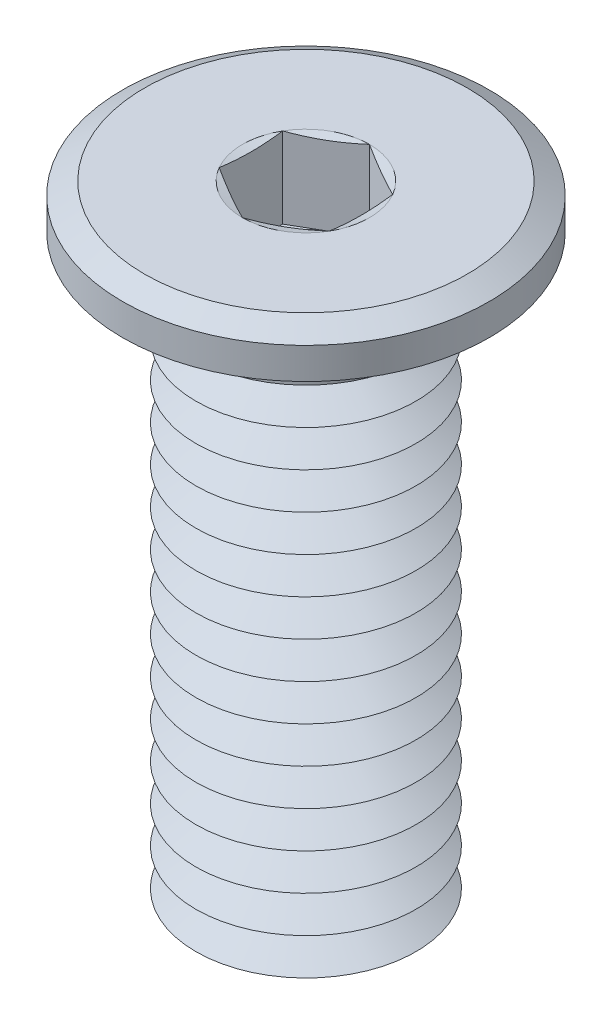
ISO-10303-21;
HEADER;
FILE_DESCRIPTION(('STEP AP214'),'2;1');
FILE_NAME('part.step','',(''),(''),'','','');
FILE_SCHEMA(('AUTOMOTIVE_DESIGN { 1 0 10303 214 1 1 1 1 }'));
ENDSEC;
DATA;
#1=APPLICATION_CONTEXT('core data for automotive mechanical design processes');
#2=APPLICATION_PROTOCOL_DEFINITION('international standard','automotive_design',2000,#1);
#3=PRODUCT_CONTEXT('',#1,'mechanical');
#4=PRODUCT('Part','Part','',(#3));
#5=PRODUCT_RELATED_PRODUCT_CATEGORY('part','',(#4));
#6=PRODUCT_DEFINITION_FORMATION('','',#4);
#7=PRODUCT_DEFINITION_CONTEXT('part definition',#1,'design');
#8=PRODUCT_DEFINITION('design','',#6,#7);
#9=PRODUCT_DEFINITION_SHAPE('','',#8);
#10=(LENGTH_UNIT() NAMED_UNIT(*) SI_UNIT(.MILLI.,.METRE.));
#11=(NAMED_UNIT(*) PLANE_ANGLE_UNIT() SI_UNIT($,.RADIAN.));
#12=(NAMED_UNIT(*) SI_UNIT($,.STERADIAN.) SOLID_ANGLE_UNIT());
#13=UNCERTAINTY_MEASURE_WITH_UNIT(LENGTH_MEASURE(1.E-05),#10,'distance_accuracy_value','');
#14=(GEOMETRIC_REPRESENTATION_CONTEXT(3) GLOBAL_UNCERTAINTY_ASSIGNED_CONTEXT((#13)) GLOBAL_UNIT_ASSIGNED_CONTEXT((#10,
#11,#12)) REPRESENTATION_CONTEXT('',''));
#15=CARTESIAN_POINT('',(0.,0.,0.));
#16=DIRECTION('',(0.,0.,1.));
#17=DIRECTION('',(1.,0.,0.));
#18=AXIS2_PLACEMENT_3D('',#15,#16,#17);
#19=CARTESIAN_POINT('',(0.,-15.7,0.));
#20=DIRECTION('',(0.,-1.,0.));
#21=DIRECTION('',(0.,0.,-1.));
#22=AXIS2_PLACEMENT_3D('',#19,#20,#21);
#23=CONICAL_SURFACE('',#22,3.,1.0471975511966);
#24=CARTESIAN_POINT('',(0.,-15.2,0.));
#25=DIRECTION('',(0.,1.,0.));
#26=DIRECTION('',(0.,0.,1.));
#27=AXIS2_PLACEMENT_3D('',#24,#25,#26);
#28=CIRCLE('',#27,2.13397459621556);
#29=CARTESIAN_POINT('',(0.,-15.2,2.13397459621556));
#30=VERTEX_POINT('',#29);
#31=EDGE_CURVE('E474',#30,#30,#28,.T.);
#32=ORIENTED_EDGE('',*,*,#31,.F.);
#33=EDGE_LOOP('',(#32));
#34=FACE_BOUND('',#33,.T.);
#35=CARTESIAN_POINT('',(0.,-15.7,0.));
#36=DIRECTION('',(0.,1.,0.));
#37=DIRECTION('',(0.,0.,1.));
#38=AXIS2_PLACEMENT_3D('',#35,#36,#37);
#39=CIRCLE('',#38,3.);
#40=CARTESIAN_POINT('',(0.,-15.7,3.));
#41=VERTEX_POINT('',#40);
#42=EDGE_CURVE('E478',#41,#41,#39,.T.);
#43=ORIENTED_EDGE('',*,*,#42,.T.);
#44=EDGE_LOOP('',(#43));
#45=FACE_BOUND('',#44,.T.);
#46=ADVANCED_FACE('F39',(#34,#45),#23,.T.);
#47=CARTESIAN_POINT('',(0.,-15.2,0.));
#48=DIRECTION('',(0.,1.,0.));
#49=DIRECTION('',(0.,0.,1.));
#50=AXIS2_PLACEMENT_3D('',#47,#48,#49);
#51=CONICAL_SURFACE('',#50,2.13397459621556,1.0471975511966);
#52=CARTESIAN_POINT('',(0.,-14.7,0.));
#53=DIRECTION('',(0.,1.,0.));
#54=DIRECTION('',(0.,0.,1.));
#55=AXIS2_PLACEMENT_3D('',#52,#53,#54);
#56=CIRCLE('',#55,3.);
#57=CARTESIAN_POINT('',(0.,-14.7,3.));
#58=VERTEX_POINT('',#57);
#59=EDGE_CURVE('E471',#58,#58,#56,.T.);
#60=ORIENTED_EDGE('',*,*,#59,.F.);
#61=EDGE_LOOP('',(#60));
#62=FACE_BOUND('',#61,.T.);
#63=ORIENTED_EDGE('',*,*,#31,.T.);
#64=EDGE_LOOP('',(#63));
#65=FACE_BOUND('',#64,.T.);
#66=ADVANCED_FACE('F233',(#62,#65),#51,.T.);
#67=CARTESIAN_POINT('',(0.,-17.2,0.));
#68=DIRECTION('',(0.,-1.,0.));
#69=DIRECTION('',(0.,0.,-1.));
#70=AXIS2_PLACEMENT_3D('',#67,#68,#69);
#71=PLANE('',#70);
#72=CARTESIAN_POINT('',(0.,-17.2,0.));
#73=DIRECTION('',(0.,1.,0.));
#74=DIRECTION('',(0.,0.,1.));
#75=AXIS2_PLACEMENT_3D('',#72,#73,#74);
#76=CIRCLE('',#75,2.13397459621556);
#77=CARTESIAN_POINT('',(0.,-17.2,2.13397459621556));
#78=VERTEX_POINT('',#77);
#79=EDGE_CURVE('E299',#78,#78,#76,.T.);
#80=ORIENTED_EDGE('',*,*,#79,.F.);
#81=EDGE_LOOP('',(#80));
#82=FACE_BOUND('',#81,.T.);
#83=ADVANCED_FACE('F239',(#82),#71,.T.);
#84=CARTESIAN_POINT('',(0.,-17.2,0.));
#85=DIRECTION('',(0.,1.,0.));
#86=DIRECTION('',(0.,0.,1.));
#87=AXIS2_PLACEMENT_3D('',#84,#85,#86);
#88=CONICAL_SURFACE('',#87,2.13397459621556,1.0471975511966);
#89=CARTESIAN_POINT('',(0.,-16.7,0.));
#90=DIRECTION('',(0.,1.,0.));
#91=DIRECTION('',(0.,0.,1.));
#92=AXIS2_PLACEMENT_3D('',#89,#90,#91);
#93=CIRCLE('',#92,3.);
#94=CARTESIAN_POINT('',(0.,-16.7,3.));
#95=VERTEX_POINT('',#94);
#96=EDGE_CURVE('E486',#95,#95,#93,.T.);
#97=ORIENTED_EDGE('',*,*,#96,.F.);
#98=EDGE_LOOP('',(#97));
#99=FACE_BOUND('',#98,.T.);
#100=ORIENTED_EDGE('',*,*,#79,.T.);
#101=EDGE_LOOP('',(#100));
#102=FACE_BOUND('',#101,.T.);
#103=ADVANCED_FACE('F254',(#99,#102),#88,.T.);
#104=CARTESIAN_POINT('',(0.,-16.7,0.));
#105=DIRECTION('',(0.,-1.,0.));
#106=DIRECTION('',(0.,0.,-1.));
#107=AXIS2_PLACEMENT_3D('',#104,#105,#106);
#108=CONICAL_SURFACE('',#107,3.,1.0471975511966);
#109=CARTESIAN_POINT('',(0.,-16.2,0.));
#110=DIRECTION('',(0.,1.,0.));
#111=DIRECTION('',(0.,0.,1.));
#112=AXIS2_PLACEMENT_3D('',#109,#110,#111);
#113=CIRCLE('',#112,2.13397459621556);
#114=CARTESIAN_POINT('',(0.,-16.2,2.13397459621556));
#115=VERTEX_POINT('',#114);
#116=EDGE_CURVE('E482',#115,#115,#113,.T.);
#117=ORIENTED_EDGE('',*,*,#116,.F.);
#118=EDGE_LOOP('',(#117));
#119=FACE_BOUND('',#118,.T.);
#120=ORIENTED_EDGE('',*,*,#96,.T.);
#121=EDGE_LOOP('',(#120));
#122=FACE_BOUND('',#121,.T.);
#123=ADVANCED_FACE('F250',(#119,#122),#108,.T.);
#124=CARTESIAN_POINT('',(0.,-16.2,0.));
#125=DIRECTION('',(0.,1.,0.));
#126=DIRECTION('',(0.,0.,1.));
#127=AXIS2_PLACEMENT_3D('',#124,#125,#126);
#128=CONICAL_SURFACE('',#127,2.13397459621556,1.0471975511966);
#129=ORIENTED_EDGE('',*,*,#42,.F.);
#130=EDGE_LOOP('',(#129));
#131=FACE_BOUND('',#130,.T.);
#132=ORIENTED_EDGE('',*,*,#116,.T.);
#133=EDGE_LOOP('',(#132));
#134=FACE_BOUND('',#133,.T.);
#135=ADVANCED_FACE('F246',(#131,#134),#128,.T.);
#136=CARTESIAN_POINT('',(0.,-14.7,0.));
#137=DIRECTION('',(0.,-1.,0.));
#138=DIRECTION('',(0.,0.,-1.));
#139=AXIS2_PLACEMENT_3D('',#136,#137,#138);
#140=CONICAL_SURFACE('',#139,3.,1.0471975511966);
#141=CARTESIAN_POINT('',(0.,-14.2,0.));
#142=DIRECTION('',(0.,1.,0.));
#143=DIRECTION('',(0.,0.,1.));
#144=AXIS2_PLACEMENT_3D('',#141,#142,#143);
#145=CIRCLE('',#144,2.13397459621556);
#146=CARTESIAN_POINT('',(0.,-14.2,2.13397459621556));
#147=VERTEX_POINT('',#146);
#148=EDGE_CURVE('E467',#147,#147,#145,.T.);
#149=ORIENTED_EDGE('',*,*,#148,.F.);
#150=EDGE_LOOP('',(#149));
#151=FACE_BOUND('',#150,.T.);
#152=ORIENTED_EDGE('',*,*,#59,.T.);
#153=EDGE_LOOP('',(#152));
#154=FACE_BOUND('',#153,.T.);
#155=ADVANCED_FACE('F249',(#151,#154),#140,.T.);
#156=CARTESIAN_POINT('',(0.,-14.2,0.));
#157=DIRECTION('',(0.,1.,0.));
#158=DIRECTION('',(0.,0.,1.));
#159=AXIS2_PLACEMENT_3D('',#156,#157,#158);
#160=CONICAL_SURFACE('',#159,2.13397459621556,1.0471975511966);
#161=CARTESIAN_POINT('',(0.,-13.7,0.));
#162=DIRECTION('',(0.,1.,0.));
#163=DIRECTION('',(0.,0.,1.));
#164=AXIS2_PLACEMENT_3D('',#161,#162,#163);
#165=CIRCLE('',#164,3.);
#166=CARTESIAN_POINT('',(0.,-13.7,3.));
#167=VERTEX_POINT('',#166);
#168=EDGE_CURVE('E463',#167,#167,#165,.T.);
#169=ORIENTED_EDGE('',*,*,#168,.F.);
#170=EDGE_LOOP('',(#169));
#171=FACE_BOUND('',#170,.T.);
#172=ORIENTED_EDGE('',*,*,#148,.T.);
#173=EDGE_LOOP('',(#172));
#174=FACE_BOUND('',#173,.T.);
#175=ADVANCED_FACE('F633',(#171,#174),#160,.T.);
#176=CARTESIAN_POINT('',(0.,-13.7,0.));
#177=DIRECTION('',(0.,-1.,0.));
#178=DIRECTION('',(0.,0.,-1.));
#179=AXIS2_PLACEMENT_3D('',#176,#177,#178);
#180=CONICAL_SURFACE('',#179,3.,1.0471975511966);
#181=CARTESIAN_POINT('',(0.,-13.2,0.));
#182=DIRECTION('',(0.,1.,0.));
#183=DIRECTION('',(0.,0.,1.));
#184=AXIS2_PLACEMENT_3D('',#181,#182,#183);
#185=CIRCLE('',#184,2.13397459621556);
#186=CARTESIAN_POINT('',(0.,-13.2,2.13397459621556));
#187=VERTEX_POINT('',#186);
#188=EDGE_CURVE('E460',#187,#187,#185,.T.);
#189=ORIENTED_EDGE('',*,*,#188,.F.);
#190=EDGE_LOOP('',(#189));
#191=FACE_BOUND('',#190,.T.);
#192=ORIENTED_EDGE('',*,*,#168,.T.);
#193=EDGE_LOOP('',(#192));
#194=FACE_BOUND('',#193,.T.);
#195=ADVANCED_FACE('F629',(#191,#194),#180,.T.);
#196=CARTESIAN_POINT('',(0.,-13.2,0.));
#197=DIRECTION('',(0.,1.,0.));
#198=DIRECTION('',(0.,0.,1.));
#199=AXIS2_PLACEMENT_3D('',#196,#197,#198);
#200=CONICAL_SURFACE('',#199,2.13397459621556,1.0471975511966);
#201=CARTESIAN_POINT('',(0.,-12.7,0.));
#202=DIRECTION('',(0.,1.,0.));
#203=DIRECTION('',(0.,0.,1.));
#204=AXIS2_PLACEMENT_3D('',#201,#202,#203);
#205=CIRCLE('',#204,3.);
#206=CARTESIAN_POINT('',(0.,-12.7,3.));
#207=VERTEX_POINT('',#206);
#208=EDGE_CURVE('E456',#207,#207,#205,.T.);
#209=ORIENTED_EDGE('',*,*,#208,.F.);
#210=EDGE_LOOP('',(#209));
#211=FACE_BOUND('',#210,.T.);
#212=ORIENTED_EDGE('',*,*,#188,.T.);
#213=EDGE_LOOP('',(#212));
#214=FACE_BOUND('',#213,.T.);
#215=ADVANCED_FACE('F625',(#211,#214),#200,.T.);
#216=CARTESIAN_POINT('',(0.,-12.7,0.));
#217=DIRECTION('',(0.,-1.,0.));
#218=DIRECTION('',(0.,0.,-1.));
#219=AXIS2_PLACEMENT_3D('',#216,#217,#218);
#220=CONICAL_SURFACE('',#219,3.,1.0471975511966);
#221=CARTESIAN_POINT('',(0.,-12.2,0.));
#222=DIRECTION('',(0.,1.,0.));
#223=DIRECTION('',(0.,0.,1.));
#224=AXIS2_PLACEMENT_3D('',#221,#222,#223);
#225=CIRCLE('',#224,2.13397459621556);
#226=CARTESIAN_POINT('',(0.,-12.2,2.13397459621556));
#227=VERTEX_POINT('',#226);
#228=EDGE_CURVE('E452',#227,#227,#225,.T.);
#229=ORIENTED_EDGE('',*,*,#228,.F.);
#230=EDGE_LOOP('',(#229));
#231=FACE_BOUND('',#230,.T.);
#232=ORIENTED_EDGE('',*,*,#208,.T.);
#233=EDGE_LOOP('',(#232));
#234=FACE_BOUND('',#233,.T.);
#235=ADVANCED_FACE('F621',(#231,#234),#220,.T.);
#236=CARTESIAN_POINT('',(0.,-12.2,0.));
#237=DIRECTION('',(0.,1.,0.));
#238=DIRECTION('',(0.,0.,1.));
#239=AXIS2_PLACEMENT_3D('',#236,#237,#238);
#240=CONICAL_SURFACE('',#239,2.13397459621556,1.0471975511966);
#241=CARTESIAN_POINT('',(0.,-11.7,0.));
#242=DIRECTION('',(0.,1.,0.));
#243=DIRECTION('',(0.,0.,1.));
#244=AXIS2_PLACEMENT_3D('',#241,#242,#243);
#245=CIRCLE('',#244,3.);
#246=CARTESIAN_POINT('',(0.,-11.7,3.));
#247=VERTEX_POINT('',#246);
#248=EDGE_CURVE('E448',#247,#247,#245,.T.);
#249=ORIENTED_EDGE('',*,*,#248,.F.);
#250=EDGE_LOOP('',(#249));
#251=FACE_BOUND('',#250,.T.);
#252=ORIENTED_EDGE('',*,*,#228,.T.);
#253=EDGE_LOOP('',(#252));
#254=FACE_BOUND('',#253,.T.);
#255=ADVANCED_FACE('F617',(#251,#254),#240,.T.);
#256=CARTESIAN_POINT('',(0.,-11.7,0.));
#257=DIRECTION('',(0.,-1.,0.));
#258=DIRECTION('',(0.,0.,-1.));
#259=AXIS2_PLACEMENT_3D('',#256,#257,#258);
#260=CONICAL_SURFACE('',#259,3.,1.0471975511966);
#261=CARTESIAN_POINT('',(0.,-11.2,0.));
#262=DIRECTION('',(0.,1.,0.));
#263=DIRECTION('',(0.,0.,1.));
#264=AXIS2_PLACEMENT_3D('',#261,#262,#263);
#265=CIRCLE('',#264,2.13397459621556);
#266=CARTESIAN_POINT('',(0.,-11.2,2.13397459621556));
#267=VERTEX_POINT('',#266);
#268=EDGE_CURVE('E445',#267,#267,#265,.T.);
#269=ORIENTED_EDGE('',*,*,#268,.F.);
#270=EDGE_LOOP('',(#269));
#271=FACE_BOUND('',#270,.T.);
#272=ORIENTED_EDGE('',*,*,#248,.T.);
#273=EDGE_LOOP('',(#272));
#274=FACE_BOUND('',#273,.T.);
#275=ADVANCED_FACE('F613',(#271,#274),#260,.T.);
#276=CARTESIAN_POINT('',(0.,-11.2,0.));
#277=DIRECTION('',(0.,1.,0.));
#278=DIRECTION('',(0.,0.,1.));
#279=AXIS2_PLACEMENT_3D('',#276,#277,#278);
#280=CONICAL_SURFACE('',#279,2.13397459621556,1.0471975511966);
#281=CARTESIAN_POINT('',(0.,-10.7,0.));
#282=DIRECTION('',(0.,1.,0.));
#283=DIRECTION('',(0.,0.,1.));
#284=AXIS2_PLACEMENT_3D('',#281,#282,#283);
#285=CIRCLE('',#284,3.);
#286=CARTESIAN_POINT('',(0.,-10.7,3.));
#287=VERTEX_POINT('',#286);
#288=EDGE_CURVE('E442',#287,#287,#285,.T.);
#289=ORIENTED_EDGE('',*,*,#288,.F.);
#290=EDGE_LOOP('',(#289));
#291=FACE_BOUND('',#290,.T.);
#292=ORIENTED_EDGE('',*,*,#268,.T.);
#293=EDGE_LOOP('',(#292));
#294=FACE_BOUND('',#293,.T.);
#295=ADVANCED_FACE('F609',(#291,#294),#280,.T.);
#296=CARTESIAN_POINT('',(0.,-10.7,0.));
#297=DIRECTION('',(0.,-1.,0.));
#298=DIRECTION('',(0.,0.,-1.));
#299=AXIS2_PLACEMENT_3D('',#296,#297,#298);
#300=CONICAL_SURFACE('',#299,3.,1.0471975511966);
#301=CARTESIAN_POINT('',(0.,-10.2,0.));
#302=DIRECTION('',(0.,1.,0.));
#303=DIRECTION('',(0.,0.,1.));
#304=AXIS2_PLACEMENT_3D('',#301,#302,#303);
#305=CIRCLE('',#304,2.13397459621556);
#306=CARTESIAN_POINT('',(0.,-10.2,2.13397459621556));
#307=VERTEX_POINT('',#306);
#308=EDGE_CURVE('E438',#307,#307,#305,.T.);
#309=ORIENTED_EDGE('',*,*,#308,.F.);
#310=EDGE_LOOP('',(#309));
#311=FACE_BOUND('',#310,.T.);
#312=ORIENTED_EDGE('',*,*,#288,.T.);
#313=EDGE_LOOP('',(#312));
#314=FACE_BOUND('',#313,.T.);
#315=ADVANCED_FACE('F605',(#311,#314),#300,.T.);
#316=CARTESIAN_POINT('',(0.,-10.2,0.));
#317=DIRECTION('',(0.,1.,0.));
#318=DIRECTION('',(0.,0.,1.));
#319=AXIS2_PLACEMENT_3D('',#316,#317,#318);
#320=CONICAL_SURFACE('',#319,2.13397459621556,1.0471975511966);
#321=CARTESIAN_POINT('',(0.,-9.7,0.));
#322=DIRECTION('',(0.,1.,0.));
#323=DIRECTION('',(0.,0.,1.));
#324=AXIS2_PLACEMENT_3D('',#321,#322,#323);
#325=CIRCLE('',#324,3.);
#326=CARTESIAN_POINT('',(0.,-9.7,3.));
#327=VERTEX_POINT('',#326);
#328=EDGE_CURVE('E434',#327,#327,#325,.T.);
#329=ORIENTED_EDGE('',*,*,#328,.F.);
#330=EDGE_LOOP('',(#329));
#331=FACE_BOUND('',#330,.T.);
#332=ORIENTED_EDGE('',*,*,#308,.T.);
#333=EDGE_LOOP('',(#332));
#334=FACE_BOUND('',#333,.T.);
#335=ADVANCED_FACE('F601',(#331,#334),#320,.T.);
#336=CARTESIAN_POINT('',(0.,-9.7,0.));
#337=DIRECTION('',(0.,-1.,0.));
#338=DIRECTION('',(0.,0.,-1.));
#339=AXIS2_PLACEMENT_3D('',#336,#337,#338);
#340=CONICAL_SURFACE('',#339,3.,1.0471975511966);
#341=CARTESIAN_POINT('',(0.,-9.2,0.));
#342=DIRECTION('',(0.,1.,0.));
#343=DIRECTION('',(0.,0.,1.));
#344=AXIS2_PLACEMENT_3D('',#341,#342,#343);
#345=CIRCLE('',#344,2.13397459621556);
#346=CARTESIAN_POINT('',(0.,-9.2,2.13397459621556));
#347=VERTEX_POINT('',#346);
#348=EDGE_CURVE('E430',#347,#347,#345,.T.);
#349=ORIENTED_EDGE('',*,*,#348,.F.);
#350=EDGE_LOOP('',(#349));
#351=FACE_BOUND('',#350,.T.);
#352=ORIENTED_EDGE('',*,*,#328,.T.);
#353=EDGE_LOOP('',(#352));
#354=FACE_BOUND('',#353,.T.);
#355=ADVANCED_FACE('F597',(#351,#354),#340,.T.);
#356=CARTESIAN_POINT('',(0.,-9.2,0.));
#357=DIRECTION('',(0.,1.,0.));
#358=DIRECTION('',(0.,0.,1.));
#359=AXIS2_PLACEMENT_3D('',#356,#357,#358);
#360=CONICAL_SURFACE('',#359,2.13397459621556,1.0471975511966);
#361=CARTESIAN_POINT('',(0.,-8.7,0.));
#362=DIRECTION('',(0.,1.,0.));
#363=DIRECTION('',(0.,0.,1.));
#364=AXIS2_PLACEMENT_3D('',#361,#362,#363);
#365=CIRCLE('',#364,3.);
#366=CARTESIAN_POINT('',(0.,-8.7,3.));
#367=VERTEX_POINT('',#366);
#368=EDGE_CURVE('E426',#367,#367,#365,.T.);
#369=ORIENTED_EDGE('',*,*,#368,.F.);
#370=EDGE_LOOP('',(#369));
#371=FACE_BOUND('',#370,.T.);
#372=ORIENTED_EDGE('',*,*,#348,.T.);
#373=EDGE_LOOP('',(#372));
#374=FACE_BOUND('',#373,.T.);
#375=ADVANCED_FACE('F593',(#371,#374),#360,.T.);
#376=CARTESIAN_POINT('',(0.,-8.7,0.));
#377=DIRECTION('',(0.,-1.,0.));
#378=DIRECTION('',(0.,0.,-1.));
#379=AXIS2_PLACEMENT_3D('',#376,#377,#378);
#380=CONICAL_SURFACE('',#379,3.,1.0471975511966);
#381=CARTESIAN_POINT('',(0.,-8.2,0.));
#382=DIRECTION('',(0.,1.,0.));
#383=DIRECTION('',(0.,0.,1.));
#384=AXIS2_PLACEMENT_3D('',#381,#382,#383);
#385=CIRCLE('',#384,2.13397459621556);
#386=CARTESIAN_POINT('',(0.,-8.2,2.13397459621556));
#387=VERTEX_POINT('',#386);
#388=EDGE_CURVE('E422',#387,#387,#385,.T.);
#389=ORIENTED_EDGE('',*,*,#388,.F.);
#390=EDGE_LOOP('',(#389));
#391=FACE_BOUND('',#390,.T.);
#392=ORIENTED_EDGE('',*,*,#368,.T.);
#393=EDGE_LOOP('',(#392));
#394=FACE_BOUND('',#393,.T.);
#395=ADVANCED_FACE('F589',(#391,#394),#380,.T.);
#396=CARTESIAN_POINT('',(0.,-8.2,0.));
#397=DIRECTION('',(0.,1.,0.));
#398=DIRECTION('',(0.,0.,1.));
#399=AXIS2_PLACEMENT_3D('',#396,#397,#398);
#400=CONICAL_SURFACE('',#399,2.13397459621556,1.0471975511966);
#401=CARTESIAN_POINT('',(0.,-7.7,0.));
#402=DIRECTION('',(0.,1.,0.));
#403=DIRECTION('',(0.,0.,1.));
#404=AXIS2_PLACEMENT_3D('',#401,#402,#403);
#405=CIRCLE('',#404,3.);
#406=CARTESIAN_POINT('',(0.,-7.7,3.));
#407=VERTEX_POINT('',#406);
#408=EDGE_CURVE('E418',#407,#407,#405,.T.);
#409=ORIENTED_EDGE('',*,*,#408,.F.);
#410=EDGE_LOOP('',(#409));
#411=FACE_BOUND('',#410,.T.);
#412=ORIENTED_EDGE('',*,*,#388,.T.);
#413=EDGE_LOOP('',(#412));
#414=FACE_BOUND('',#413,.T.);
#415=ADVANCED_FACE('F585',(#411,#414),#400,.T.);
#416=CARTESIAN_POINT('',(0.,-7.7,0.));
#417=DIRECTION('',(0.,-1.,0.));
#418=DIRECTION('',(0.,0.,-1.));
#419=AXIS2_PLACEMENT_3D('',#416,#417,#418);
#420=CONICAL_SURFACE('',#419,3.,1.0471975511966);
#421=CARTESIAN_POINT('',(0.,-7.2,0.));
#422=DIRECTION('',(0.,1.,0.));
#423=DIRECTION('',(0.,0.,1.));
#424=AXIS2_PLACEMENT_3D('',#421,#422,#423);
#425=CIRCLE('',#424,2.13397459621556);
#426=CARTESIAN_POINT('',(0.,-7.2,2.13397459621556));
#427=VERTEX_POINT('',#426);
#428=EDGE_CURVE('E414',#427,#427,#425,.T.);
#429=ORIENTED_EDGE('',*,*,#428,.F.);
#430=EDGE_LOOP('',(#429));
#431=FACE_BOUND('',#430,.T.);
#432=ORIENTED_EDGE('',*,*,#408,.T.);
#433=EDGE_LOOP('',(#432));
#434=FACE_BOUND('',#433,.T.);
#435=ADVANCED_FACE('F581',(#431,#434),#420,.T.);
#436=CARTESIAN_POINT('',(0.,-7.2,0.));
#437=DIRECTION('',(0.,1.,0.));
#438=DIRECTION('',(0.,0.,1.));
#439=AXIS2_PLACEMENT_3D('',#436,#437,#438);
#440=CONICAL_SURFACE('',#439,2.13397459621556,1.0471975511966);
#441=CARTESIAN_POINT('',(0.,-6.7,0.));
#442=DIRECTION('',(0.,1.,0.));
#443=DIRECTION('',(0.,0.,1.));
#444=AXIS2_PLACEMENT_3D('',#441,#442,#443);
#445=CIRCLE('',#444,3.);
#446=CARTESIAN_POINT('',(0.,-6.7,3.));
#447=VERTEX_POINT('',#446);
#448=EDGE_CURVE('E410',#447,#447,#445,.T.);
#449=ORIENTED_EDGE('',*,*,#448,.F.);
#450=EDGE_LOOP('',(#449));
#451=FACE_BOUND('',#450,.T.);
#452=ORIENTED_EDGE('',*,*,#428,.T.);
#453=EDGE_LOOP('',(#452));
#454=FACE_BOUND('',#453,.T.);
#455=ADVANCED_FACE('F577',(#451,#454),#440,.T.);
#456=CARTESIAN_POINT('',(0.,-6.7,0.));
#457=DIRECTION('',(0.,-1.,0.));
#458=DIRECTION('',(0.,0.,-1.));
#459=AXIS2_PLACEMENT_3D('',#456,#457,#458);
#460=CONICAL_SURFACE('',#459,3.,1.0471975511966);
#461=CARTESIAN_POINT('',(0.,-6.2,0.));
#462=DIRECTION('',(0.,1.,0.));
#463=DIRECTION('',(0.,0.,1.));
#464=AXIS2_PLACEMENT_3D('',#461,#462,#463);
#465=CIRCLE('',#464,2.13397459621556);
#466=CARTESIAN_POINT('',(0.,-6.2,2.13397459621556));
#467=VERTEX_POINT('',#466);
#468=EDGE_CURVE('E406',#467,#467,#465,.T.);
#469=ORIENTED_EDGE('',*,*,#468,.F.);
#470=EDGE_LOOP('',(#469));
#471=FACE_BOUND('',#470,.T.);
#472=ORIENTED_EDGE('',*,*,#448,.T.);
#473=EDGE_LOOP('',(#472));
#474=FACE_BOUND('',#473,.T.);
#475=ADVANCED_FACE('F573',(#471,#474),#460,.T.);
#476=CARTESIAN_POINT('',(0.,-6.2,0.));
#477=DIRECTION('',(0.,1.,0.));
#478=DIRECTION('',(0.,0.,1.));
#479=AXIS2_PLACEMENT_3D('',#476,#477,#478);
#480=CONICAL_SURFACE('',#479,2.13397459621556,1.0471975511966);
#481=CARTESIAN_POINT('',(0.,-5.7,0.));
#482=DIRECTION('',(0.,1.,0.));
#483=DIRECTION('',(0.,0.,1.));
#484=AXIS2_PLACEMENT_3D('',#481,#482,#483);
#485=CIRCLE('',#484,3.);
#486=CARTESIAN_POINT('',(0.,-5.7,3.));
#487=VERTEX_POINT('',#486);
#488=EDGE_CURVE('E402',#487,#487,#485,.T.);
#489=ORIENTED_EDGE('',*,*,#488,.F.);
#490=EDGE_LOOP('',(#489));
#491=FACE_BOUND('',#490,.T.);
#492=ORIENTED_EDGE('',*,*,#468,.T.);
#493=EDGE_LOOP('',(#492));
#494=FACE_BOUND('',#493,.T.);
#495=ADVANCED_FACE('F569',(#491,#494),#480,.T.);
#496=CARTESIAN_POINT('',(0.,-5.7,0.));
#497=DIRECTION('',(0.,-1.,0.));
#498=DIRECTION('',(0.,0.,-1.));
#499=AXIS2_PLACEMENT_3D('',#496,#497,#498);
#500=CONICAL_SURFACE('',#499,3.,1.0471975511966);
#501=CARTESIAN_POINT('',(0.,-5.2,0.));
#502=DIRECTION('',(0.,1.,0.));
#503=DIRECTION('',(0.,0.,1.));
#504=AXIS2_PLACEMENT_3D('',#501,#502,#503);
#505=CIRCLE('',#504,2.13397459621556);
#506=CARTESIAN_POINT('',(0.,-5.2,2.13397459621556));
#507=VERTEX_POINT('',#506);
#508=EDGE_CURVE('E398',#507,#507,#505,.T.);
#509=ORIENTED_EDGE('',*,*,#508,.F.);
#510=EDGE_LOOP('',(#509));
#511=FACE_BOUND('',#510,.T.);
#512=ORIENTED_EDGE('',*,*,#488,.T.);
#513=EDGE_LOOP('',(#512));
#514=FACE_BOUND('',#513,.T.);
#515=ADVANCED_FACE('F565',(#511,#514),#500,.T.);
#516=CARTESIAN_POINT('',(0.,-5.2,0.));
#517=DIRECTION('',(0.,1.,0.));
#518=DIRECTION('',(0.,0.,1.));
#519=AXIS2_PLACEMENT_3D('',#516,#517,#518);
#520=CONICAL_SURFACE('',#519,2.13397459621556,1.0471975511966);
#521=CARTESIAN_POINT('',(0.,-4.7,0.));
#522=DIRECTION('',(0.,1.,0.));
#523=DIRECTION('',(0.,0.,1.));
#524=AXIS2_PLACEMENT_3D('',#521,#522,#523);
#525=CIRCLE('',#524,3.);
#526=CARTESIAN_POINT('',(0.,-4.7,3.));
#527=VERTEX_POINT('',#526);
#528=EDGE_CURVE('E394',#527,#527,#525,.T.);
#529=ORIENTED_EDGE('',*,*,#528,.F.);
#530=EDGE_LOOP('',(#529));
#531=FACE_BOUND('',#530,.T.);
#532=ORIENTED_EDGE('',*,*,#508,.T.);
#533=EDGE_LOOP('',(#532));
#534=FACE_BOUND('',#533,.T.);
#535=ADVANCED_FACE('F561',(#531,#534),#520,.T.);
#536=CARTESIAN_POINT('',(0.,-4.7,0.));
#537=DIRECTION('',(0.,-1.,0.));
#538=DIRECTION('',(0.,0.,-1.));
#539=AXIS2_PLACEMENT_3D('',#536,#537,#538);
#540=CONICAL_SURFACE('',#539,3.,1.0471975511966);
#541=CARTESIAN_POINT('',(0.,-4.2,0.));
#542=DIRECTION('',(0.,1.,0.));
#543=DIRECTION('',(0.,0.,1.));
#544=AXIS2_PLACEMENT_3D('',#541,#542,#543);
#545=CIRCLE('',#544,2.13397459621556);
#546=CARTESIAN_POINT('',(0.,-4.2,2.13397459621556));
#547=VERTEX_POINT('',#546);
#548=EDGE_CURVE('E390',#547,#547,#545,.T.);
#549=ORIENTED_EDGE('',*,*,#548,.F.);
#550=EDGE_LOOP('',(#549));
#551=FACE_BOUND('',#550,.T.);
#552=ORIENTED_EDGE('',*,*,#528,.T.);
#553=EDGE_LOOP('',(#552));
#554=FACE_BOUND('',#553,.T.);
#555=ADVANCED_FACE('F557',(#551,#554),#540,.T.);
#556=CARTESIAN_POINT('',(0.,-4.2,0.));
#557=DIRECTION('',(0.,1.,0.));
#558=DIRECTION('',(0.,0.,1.));
#559=AXIS2_PLACEMENT_3D('',#556,#557,#558);
#560=CONICAL_SURFACE('',#559,2.13397459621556,1.0471975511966);
#561=CARTESIAN_POINT('',(0.,-3.7,0.));
#562=DIRECTION('',(0.,1.,0.));
#563=DIRECTION('',(0.,0.,1.));
#564=AXIS2_PLACEMENT_3D('',#561,#562,#563);
#565=CIRCLE('',#564,3.);
#566=CARTESIAN_POINT('',(0.,-3.7,3.));
#567=VERTEX_POINT('',#566);
#568=EDGE_CURVE('E386',#567,#567,#565,.T.);
#569=ORIENTED_EDGE('',*,*,#568,.F.);
#570=EDGE_LOOP('',(#569));
#571=FACE_BOUND('',#570,.T.);
#572=ORIENTED_EDGE('',*,*,#548,.T.);
#573=EDGE_LOOP('',(#572));
#574=FACE_BOUND('',#573,.T.);
#575=ADVANCED_FACE('F553',(#571,#574),#560,.T.);
#576=CARTESIAN_POINT('',(0.,-3.7,0.));
#577=DIRECTION('',(0.,-1.,0.));
#578=DIRECTION('',(0.,0.,-1.));
#579=AXIS2_PLACEMENT_3D('',#576,#577,#578);
#580=CONICAL_SURFACE('',#579,3.,1.0471975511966);
#581=CARTESIAN_POINT('',(0.,-3.2,0.));
#582=DIRECTION('',(0.,1.,0.));
#583=DIRECTION('',(0.,0.,1.));
#584=AXIS2_PLACEMENT_3D('',#581,#582,#583);
#585=CIRCLE('',#584,2.13397459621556);
#586=CARTESIAN_POINT('',(0.,-3.2,2.13397459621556));
#587=VERTEX_POINT('',#586);
#588=EDGE_CURVE('E382',#587,#587,#585,.T.);
#589=ORIENTED_EDGE('',*,*,#588,.F.);
#590=EDGE_LOOP('',(#589));
#591=FACE_BOUND('',#590,.T.);
#592=ORIENTED_EDGE('',*,*,#568,.T.);
#593=EDGE_LOOP('',(#592));
#594=FACE_BOUND('',#593,.T.);
#595=ADVANCED_FACE('F549',(#591,#594),#580,.T.);
#596=CARTESIAN_POINT('',(0.,-3.2,0.));
#597=DIRECTION('',(0.,1.,0.));
#598=DIRECTION('',(0.,0.,1.));
#599=AXIS2_PLACEMENT_3D('',#596,#597,#598);
#600=CONICAL_SURFACE('',#599,2.13397459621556,1.0471975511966);
#601=CARTESIAN_POINT('',(0.,-2.7,0.));
#602=DIRECTION('',(0.,1.,0.));
#603=DIRECTION('',(0.,0.,1.));
#604=AXIS2_PLACEMENT_3D('',#601,#602,#603);
#605=CIRCLE('',#604,3.);
#606=CARTESIAN_POINT('',(0.,-2.7,3.));
#607=VERTEX_POINT('',#606);
#608=EDGE_CURVE('E366',#607,#607,#605,.T.);
#609=ORIENTED_EDGE('',*,*,#608,.F.);
#610=EDGE_LOOP('',(#609));
#611=FACE_BOUND('',#610,.T.);
#612=ORIENTED_EDGE('',*,*,#588,.T.);
#613=EDGE_LOOP('',(#612));
#614=FACE_BOUND('',#613,.T.);
#615=ADVANCED_FACE('F274',(#611,#614),#600,.T.);
#616=CARTESIAN_POINT('',(0.,0.,0.));
#617=DIRECTION('',(0.,1.,0.));
#618=DIRECTION('',(0.,0.,1.));
#619=AXIS2_PLACEMENT_3D('',#616,#617,#618);
#620=PLANE('',#619);
#621=CARTESIAN_POINT('',(0.,0.,0.));
#622=DIRECTION('',(0.,1.,0.));
#623=DIRECTION('',(0.,0.,1.));
#624=AXIS2_PLACEMENT_3D('',#621,#622,#623);
#625=CIRCLE('',#624,1.73205080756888);
#626=CARTESIAN_POINT('',(0.,0.,1.73205080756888));
#627=VERTEX_POINT('',#626);
#628=CARTESIAN_POINT('',(1.5,0.,0.86602540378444));
#629=VERTEX_POINT('',#628);
#630=EDGE_CURVE('E66',#627,#629,#625,.T.);
#631=ORIENTED_EDGE('',*,*,#630,.F.);
#632=CARTESIAN_POINT('',(-1.5,0.,0.866025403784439));
#633=VERTEX_POINT('',#632);
#634=EDGE_CURVE('E169',#633,#627,#625,.T.);
#635=ORIENTED_EDGE('',*,*,#634,.F.);
#636=CARTESIAN_POINT('',(-1.5,0.,-0.86602540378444));
#637=VERTEX_POINT('',#636);
#638=EDGE_CURVE('E164',#637,#633,#625,.T.);
#639=ORIENTED_EDGE('',*,*,#638,.F.);
#640=CARTESIAN_POINT('',(0.,0.,-1.73205080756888));
#641=VERTEX_POINT('',#640);
#642=EDGE_CURVE('E128',#641,#637,#625,.T.);
#643=ORIENTED_EDGE('',*,*,#642,.F.);
#644=CARTESIAN_POINT('',(1.5,0.,-0.866025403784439));
#645=VERTEX_POINT('',#644);
#646=EDGE_CURVE('E119',#645,#641,#625,.T.);
#647=ORIENTED_EDGE('',*,*,#646,.F.);
#648=EDGE_CURVE('E59',#629,#645,#625,.T.);
#649=ORIENTED_EDGE('',*,*,#648,.F.);
#650=EDGE_LOOP('',(#631,#635,#639,#643,#647,#649));
#651=FACE_BOUND('',#650,.T.);
#652=CARTESIAN_POINT('',(0.,0.,0.));
#653=DIRECTION('',(0.,1.,0.));
#654=DIRECTION('',(0.,0.,1.));
#655=AXIS2_PLACEMENT_3D('',#652,#653,#654);
#656=CIRCLE('',#655,4.4);
#657=CARTESIAN_POINT('',(0.,0.,4.4));
#658=VERTEX_POINT('',#657);
#659=EDGE_CURVE('E295',#658,#658,#656,.T.);
#660=ORIENTED_EDGE('',*,*,#659,.T.);
#661=EDGE_LOOP('',(#660));
#662=FACE_BOUND('',#661,.T.);
#663=ADVANCED_FACE('F160',(#651,#662),#620,.T.);
#664=CARTESIAN_POINT('',(0.,-1.2,0.));
#665=DIRECTION('',(0.,1.,0.));
#666=DIRECTION('',(0.,0.,1.));
#667=AXIS2_PLACEMENT_3D('',#664,#665,#666);
#668=CYLINDRICAL_SURFACE('',#667,5.);
#669=CARTESIAN_POINT('',(0.,-0.346410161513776,0.));
#670=DIRECTION('',(0.,1.,0.));
#671=DIRECTION('',(0.,0.,1.));
#672=AXIS2_PLACEMENT_3D('',#669,#670,#671);
#673=CIRCLE('',#672,5.);
#674=CARTESIAN_POINT('',(0.,-0.346410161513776,5.));
#675=VERTEX_POINT('',#674);
#676=EDGE_CURVE('E306',#675,#675,#673,.F.);
#677=ORIENTED_EDGE('',*,*,#676,.T.);
#678=EDGE_LOOP('',(#677));
#679=FACE_BOUND('',#678,.T.);
#680=CARTESIAN_POINT('',(0.,-1.2,0.));
#681=DIRECTION('',(0.,1.,0.));
#682=DIRECTION('',(0.,0.,1.));
#683=AXIS2_PLACEMENT_3D('',#680,#681,#682);
#684=CIRCLE('',#683,5.);
#685=CARTESIAN_POINT('',(0.,-1.2,5.));
#686=VERTEX_POINT('',#685);
#687=EDGE_CURVE('E291',#686,#686,#684,.T.);
#688=ORIENTED_EDGE('',*,*,#687,.T.);
#689=EDGE_LOOP('',(#688));
#690=FACE_BOUND('',#689,.T.);
#691=ADVANCED_FACE('F270',(#679,#690),#668,.T.);
#692=CARTESIAN_POINT('',(0.,-1.2,0.));
#693=DIRECTION('',(0.,1.,0.));
#694=DIRECTION('',(0.,0.,1.));
#695=AXIS2_PLACEMENT_3D('',#692,#693,#694);
#696=PLANE('',#695);
#697=CARTESIAN_POINT('',(0.,-1.2,0.));
#698=DIRECTION('',(0.,1.,0.));
#699=DIRECTION('',(0.,0.,1.));
#700=AXIS2_PLACEMENT_3D('',#697,#698,#699);
#701=CIRCLE('',#700,3.25);
#702=CARTESIAN_POINT('',(0.,-1.2,3.25));
#703=VERTEX_POINT('',#702);
#704=EDGE_CURVE('E286',#703,#703,#701,.T.);
#705=ORIENTED_EDGE('',*,*,#704,.T.);
#706=EDGE_LOOP('',(#705));
#707=FACE_BOUND('',#706,.T.);
#708=ORIENTED_EDGE('',*,*,#687,.F.);
#709=EDGE_LOOP('',(#708));
#710=FACE_BOUND('',#709,.T.);
#711=ADVANCED_FACE('F266',(#707,#710),#696,.F.);
#712=CARTESIAN_POINT('',(0.,-17.2,0.));
#713=DIRECTION('',(0.,1.,0.));
#714=DIRECTION('',(0.,0.,1.));
#715=AXIS2_PLACEMENT_3D('',#712,#713,#714);
#716=CYLINDRICAL_SURFACE('',#715,3.);
#717=CARTESIAN_POINT('',(0.,-1.45,0.));
#718=DIRECTION('',(0.,1.,0.));
#719=DIRECTION('',(0.,0.,1.));
#720=AXIS2_PLACEMENT_3D('',#717,#718,#719);
#721=CIRCLE('',#720,3.);
#722=CARTESIAN_POINT('',(0.,-1.45,3.));
#723=VERTEX_POINT('',#722);
#724=EDGE_CURVE('E289',#723,#723,#721,.F.);
#725=ORIENTED_EDGE('',*,*,#724,.T.);
#726=EDGE_LOOP('',(#725));
#727=FACE_BOUND('',#726,.T.);
#728=ORIENTED_EDGE('',*,*,#608,.T.);
#729=EDGE_LOOP('',(#728));
#730=FACE_BOUND('',#729,.T.);
#731=ADVANCED_FACE('F262',(#727,#730),#716,.T.);
#732=CARTESIAN_POINT('',(0.,-1.45,0.));
#733=DIRECTION('',(0.,1.,0.));
#734=DIRECTION('',(0.,0.,1.));
#735=AXIS2_PLACEMENT_3D('',#732,#733,#734);
#736=TOROIDAL_SURFACE('',#735,3.25,0.25);
#737=ORIENTED_EDGE('',*,*,#704,.F.);
#738=EDGE_LOOP('',(#737));
#739=FACE_BOUND('',#738,.T.);
#740=ORIENTED_EDGE('',*,*,#724,.F.);
#741=EDGE_LOOP('',(#740));
#742=FACE_BOUND('',#741,.T.);
#743=ADVANCED_FACE('F265',(#739,#742),#736,.F.);
#744=CARTESIAN_POINT('',(0.,0.,0.));
#745=DIRECTION('',(0.,-1.,0.));
#746=DIRECTION('',(0.,0.,-1.));
#747=AXIS2_PLACEMENT_3D('',#744,#745,#746);
#748=CONICAL_SURFACE('',#747,4.4,1.0471975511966);
#749=ORIENTED_EDGE('',*,*,#676,.F.);
#750=EDGE_LOOP('',(#749));
#751=FACE_BOUND('',#750,.T.);
#752=ORIENTED_EDGE('',*,*,#659,.F.);
#753=EDGE_LOOP('',(#752));
#754=FACE_BOUND('',#753,.T.);
#755=ADVANCED_FACE('F41',(#751,#754),#748,.T.);
#756=CARTESIAN_POINT('',(0.,0.,0.));
#757=DIRECTION('',(0.,1.,0.));
#758=DIRECTION('',(0.,0.,1.));
#759=AXIS2_PLACEMENT_3D('',#756,#757,#758);
#760=CONICAL_SURFACE('',#759,1.73205080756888,1.30899693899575);
#761=ORIENTED_EDGE('',*,*,#642,.T.);
#762=CARTESIAN_POINT('',(0.000200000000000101,3.09432014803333E-05,-1.73216627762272));
#763=CARTESIAN_POINT('',(-0.0621077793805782,-0.00961367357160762,-1.69619286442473));
#764=CARTESIAN_POINT('',(-0.124528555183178,-0.0183695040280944,-1.66015421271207));
#765=CARTESIAN_POINT('',(-0.249590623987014,-0.0337528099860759,-1.58794959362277));
#766=CARTESIAN_POINT('',(-0.312231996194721,-0.0403794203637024,-1.55178358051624));
#767=CARTESIAN_POINT('',(-0.437355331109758,-0.0511173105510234,-1.47954358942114));
#768=CARTESIAN_POINT('',(-0.499836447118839,-0.0552413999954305,-1.44347010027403));
#769=CARTESIAN_POINT('',(-0.624878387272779,-0.0607713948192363,-1.37127710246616));
#770=CARTESIAN_POINT('',(-0.68743919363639,-0.0621778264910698,-1.33515760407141));
#771=CARTESIAN_POINT('',(-0.81256080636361,-0.0621778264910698,-1.26291860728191));
#772=CARTESIAN_POINT('',(-0.875121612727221,-0.0607713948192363,-1.22679910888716));
#773=CARTESIAN_POINT('',(-1.00016355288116,-0.0552413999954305,-1.15460611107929));
#774=CARTESIAN_POINT('',(-1.06264466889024,-0.0511173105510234,-1.11853262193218));
#775=CARTESIAN_POINT('',(-1.18776800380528,-0.0403794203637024,-1.04629263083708));
#776=CARTESIAN_POINT('',(-1.25040937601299,-0.0337528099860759,-1.01012661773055));
#777=CARTESIAN_POINT('',(-1.37547144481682,-0.0183695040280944,-0.937921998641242));
#778=CARTESIAN_POINT('',(-1.43789222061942,-0.00961367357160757,-0.901883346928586));
#779=CARTESIAN_POINT('',(-1.5002,3.09432014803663E-05,-0.865909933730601));
#780=B_SPLINE_CURVE_WITH_KNOTS('',3,(#762,#763,#764,#765,#766,#767,#768,#769,#770,#771,#772,
#773,#774,#775,#776,#777,#778,#779),.UNSPECIFIED.,.F.,.F.,(4,2,2,2,2,2,2,2,4),(0.,
0.217782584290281,0.435653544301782,0.652399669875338,0.869103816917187,1.08580796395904,
1.30255408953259,1.52042504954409,1.73820763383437),.UNSPECIFIED.);
#781=EDGE_CURVE('E11',#641,#637,#780,.T.);
#782=ORIENTED_EDGE('',*,*,#781,.F.);
#783=EDGE_LOOP('',(#761,#782));
#784=FACE_BOUND('',#783,.T.);
#785=ADVANCED_FACE('F132',(#784),#760,.F.);
#786=ORIENTED_EDGE('',*,*,#638,.T.);
#787=CARTESIAN_POINT('',(-1.5,0.354011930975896,-2.65937634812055));
#788=CARTESIAN_POINT('',(-1.5,0.324139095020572,-2.53120070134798));
#789=CARTESIAN_POINT('',(-1.5,0.294685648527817,-2.40292071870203));
#790=CARTESIAN_POINT('',(-1.5,0.237197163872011,-2.14601955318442));
#791=CARTESIAN_POINT('',(-1.5,0.209162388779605,-2.01739831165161));
#792=CARTESIAN_POINT('',(-1.5,0.154839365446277,-1.7584759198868));
#793=CARTESIAN_POINT('',(-1.5,0.128570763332,-1.62817060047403));
#794=CARTESIAN_POINT('',(-1.5,0.079114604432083,-1.36695300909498));
#795=CARTESIAN_POINT('',(-1.5,0.0559273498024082,-1.23604067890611));
#796=CARTESIAN_POINT('',(-1.5,0.014778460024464,-0.977065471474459));
#797=CARTESIAN_POINT('',(-1.5,-0.00330931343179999,-0.849023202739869));
#798=CARTESIAN_POINT('',(-1.5,-0.0330965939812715,-0.592203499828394));
#799=CARTESIAN_POINT('',(-1.5,-0.044798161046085,-0.463426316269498));
#800=CARTESIAN_POINT('',(-1.5,-0.0597912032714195,-0.205943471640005));
#801=CARTESIAN_POINT('',(-1.5,-0.0631209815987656,-0.0772401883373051));
#802=CARTESIAN_POINT('',(-1.5,-0.0607624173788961,0.180089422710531));
#803=CARTESIAN_POINT('',(-1.5,-0.0550734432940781,0.30871574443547));
#804=CARTESIAN_POINT('',(-1.5,-0.0385156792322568,0.529862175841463));
#805=CARTESIAN_POINT('',(-1.5,-0.0295136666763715,0.622533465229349));
#806=CARTESIAN_POINT('',(-1.5,-0.00818858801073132,0.807485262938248));
#807=CARTESIAN_POINT('',(-1.5,0.00413439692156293,0.899765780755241));
#808=CARTESIAN_POINT('',(-1.5,0.0313970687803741,1.08424538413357));
#809=CARTESIAN_POINT('',(-1.5,0.0463453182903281,1.17644317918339));
#810=CARTESIAN_POINT('',(-1.5,0.0781915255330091,1.36050255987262));
#811=CARTESIAN_POINT('',(-1.5,0.0950895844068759,1.45236412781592));
#812=CARTESIAN_POINT('',(-1.5,0.130717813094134,1.6377417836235));
#813=CARTESIAN_POINT('',(-1.5,0.149479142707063,1.73125183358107));
#814=CARTESIAN_POINT('',(-1.5,0.188141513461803,1.91803588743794));
#815=CARTESIAN_POINT('',(-1.5,0.208042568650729,2.01130988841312));
#816=CARTESIAN_POINT('',(-1.5,0.248588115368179,2.19713640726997));
#817=CARTESIAN_POINT('',(-1.5,0.269227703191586,2.28969000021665));
#818=CARTESIAN_POINT('',(-1.5,0.311169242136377,2.47464021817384));
#819=CARTESIAN_POINT('',(-1.5,0.332471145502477,2.5670368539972));
#820=CARTESIAN_POINT('',(-1.5,0.354011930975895,2.65937634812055));
#821=B_SPLINE_CURVE_WITH_KNOTS('',3,(#787,#788,#789,#790,#791,#792,#793,#794,#795,#796,#797,
#798,#799,#800,#801,#802,#803,#804,#805,#806,#807,#808,#809,#810,#811,#812,#813,#814,#815,#816,
#817,#818,#819,#820),.UNSPECIFIED.,.F.,.F.,(4,2,2,2,2,2,2,2,2,2,2,2,2,2,2,2,4),(0.,
0.3948412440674,0.789755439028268,1.18851185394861,1.58730734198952,1.97513907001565,
2.36284562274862,2.74877505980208,3.13473152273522,3.41398847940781,3.69323861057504,
3.97341705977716,4.25361004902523,4.53972148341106,4.82583644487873,5.1103147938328,
5.39477267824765),.UNSPECIFIED.);
#822=EDGE_CURVE('E172',#637,#633,#821,.T.);
#823=ORIENTED_EDGE('',*,*,#822,.F.);
#824=EDGE_LOOP('',(#786,#823));
#825=FACE_BOUND('',#824,.T.);
#826=ADVANCED_FACE('F745',(#825),#760,.F.);
#827=ORIENTED_EDGE('',*,*,#634,.T.);
#828=CARTESIAN_POINT('',(-1.5002,3.09432014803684E-05,0.865909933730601));
#829=CARTESIAN_POINT('',(-1.43789222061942,-0.00961367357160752,0.901883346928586));
#830=CARTESIAN_POINT('',(-1.37547144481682,-0.0183695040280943,0.937921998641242));
#831=CARTESIAN_POINT('',(-1.25040937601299,-0.0337528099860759,1.01012661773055));
#832=CARTESIAN_POINT('',(-1.18776800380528,-0.0403794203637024,1.04629263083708));
#833=CARTESIAN_POINT('',(-1.06264466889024,-0.0511173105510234,1.11853262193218));
#834=CARTESIAN_POINT('',(-1.00016355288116,-0.0552413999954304,1.15460611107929));
#835=CARTESIAN_POINT('',(-0.875121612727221,-0.0607713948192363,1.22679910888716));
#836=CARTESIAN_POINT('',(-0.812560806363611,-0.0621778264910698,1.26291860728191));
#837=CARTESIAN_POINT('',(-0.68743919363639,-0.0621778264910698,1.33515760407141));
#838=CARTESIAN_POINT('',(-0.624878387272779,-0.0607713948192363,1.37127710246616));
#839=CARTESIAN_POINT('',(-0.499836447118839,-0.0552413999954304,1.44347010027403));
#840=CARTESIAN_POINT('',(-0.437355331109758,-0.0511173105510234,1.47954358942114));
#841=CARTESIAN_POINT('',(-0.312231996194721,-0.0403794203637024,1.55178358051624));
#842=CARTESIAN_POINT('',(-0.249590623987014,-0.0337528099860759,1.58794959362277));
#843=CARTESIAN_POINT('',(-0.124528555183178,-0.0183695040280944,1.66015421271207));
#844=CARTESIAN_POINT('',(-0.0621077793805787,-0.00961367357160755,1.69619286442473));
#845=CARTESIAN_POINT('',(0.000199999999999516,3.09432014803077E-05,1.73216627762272));
#846=B_SPLINE_CURVE_WITH_KNOTS('',3,(#828,#829,#830,#831,#832,#833,#834,#835,#836,#837,#838,
#839,#840,#841,#842,#843,#844,#845),.UNSPECIFIED.,.F.,.F.,(4,2,2,2,2,2,2,2,4),(0.,
0.217782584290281,0.435653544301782,0.652399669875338,0.869103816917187,1.08580796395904,
1.30255408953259,1.52042504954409,1.73820763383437),.UNSPECIFIED.);
#847=EDGE_CURVE('E180',#633,#627,#846,.T.);
#848=ORIENTED_EDGE('',*,*,#847,.F.);
#849=EDGE_LOOP('',(#827,#848));
#850=FACE_BOUND('',#849,.T.);
#851=ADVANCED_FACE('F752',(#850),#760,.F.);
#852=ORIENTED_EDGE('',*,*,#630,.T.);
#853=CARTESIAN_POINT('',(-0.000200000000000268,3.09432014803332E-05,1.73216627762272));
#854=CARTESIAN_POINT('',(0.062107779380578,-0.00961367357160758,1.69619286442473));
#855=CARTESIAN_POINT('',(0.124528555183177,-0.0183695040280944,1.66015421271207));
#856=CARTESIAN_POINT('',(0.249590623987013,-0.0337528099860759,1.58794959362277));
#857=CARTESIAN_POINT('',(0.312231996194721,-0.0403794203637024,1.55178358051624));
#858=CARTESIAN_POINT('',(0.437355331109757,-0.0511173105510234,1.47954358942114));
#859=CARTESIAN_POINT('',(0.499836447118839,-0.0552413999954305,1.44347010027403));
#860=CARTESIAN_POINT('',(0.624878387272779,-0.0607713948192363,1.37127710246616));
#861=CARTESIAN_POINT('',(0.687439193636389,-0.0621778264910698,1.33515760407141));
#862=CARTESIAN_POINT('',(0.81256080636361,-0.0621778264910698,1.26291860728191));
#863=CARTESIAN_POINT('',(0.87512161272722,-0.0607713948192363,1.22679910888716));
#864=CARTESIAN_POINT('',(1.00016355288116,-0.0552413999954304,1.15460611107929));
#865=CARTESIAN_POINT('',(1.06264466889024,-0.0511173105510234,1.11853262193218));
#866=CARTESIAN_POINT('',(1.18776800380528,-0.0403794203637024,1.04629263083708));
#867=CARTESIAN_POINT('',(1.25040937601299,-0.0337528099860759,1.01012661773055));
#868=CARTESIAN_POINT('',(1.37547144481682,-0.0183695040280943,0.937921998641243));
#869=CARTESIAN_POINT('',(1.43789222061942,-0.00961367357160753,0.901883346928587));
#870=CARTESIAN_POINT('',(1.5002,3.09432014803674E-05,0.865909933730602));
#871=B_SPLINE_CURVE_WITH_KNOTS('',3,(#853,#854,#855,#856,#857,#858,#859,#860,#861,#862,#863,
#864,#865,#866,#867,#868,#869,#870),.UNSPECIFIED.,.F.,.F.,(4,2,2,2,2,2,2,2,4),(0.,
0.217782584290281,0.435653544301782,0.652399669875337,0.869103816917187,1.08580796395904,
1.30255408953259,1.52042504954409,1.73820763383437),.UNSPECIFIED.);
#872=EDGE_CURVE('E199',#627,#629,#871,.T.);
#873=ORIENTED_EDGE('',*,*,#872,.F.);
#874=EDGE_LOOP('',(#852,#873));
#875=FACE_BOUND('',#874,.T.);
#876=ADVANCED_FACE('F760',(#875),#760,.F.);
#877=ORIENTED_EDGE('',*,*,#648,.T.);
#878=CARTESIAN_POINT('',(1.5,0.354011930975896,2.65937634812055));
#879=CARTESIAN_POINT('',(1.5,0.324139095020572,2.53120070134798));
#880=CARTESIAN_POINT('',(1.5,0.294685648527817,2.40292071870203));
#881=CARTESIAN_POINT('',(1.5,0.237197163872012,2.14601955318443));
#882=CARTESIAN_POINT('',(1.5,0.209162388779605,2.01739831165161));
#883=CARTESIAN_POINT('',(1.5,0.154839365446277,1.7584759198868));
#884=CARTESIAN_POINT('',(1.5,0.128570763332,1.62817060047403));
#885=CARTESIAN_POINT('',(1.5,0.0791146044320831,1.36695300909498));
#886=CARTESIAN_POINT('',(1.5,0.0559273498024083,1.23604067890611));
#887=CARTESIAN_POINT('',(1.5,0.0147784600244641,0.97706547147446));
#888=CARTESIAN_POINT('',(1.5,-0.00330931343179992,0.849023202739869));
#889=CARTESIAN_POINT('',(1.5,-0.0330965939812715,0.592203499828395));
#890=CARTESIAN_POINT('',(1.5,-0.044798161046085,0.463426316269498));
#891=CARTESIAN_POINT('',(1.5,-0.0597912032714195,0.205943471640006));
#892=CARTESIAN_POINT('',(1.5,-0.0631209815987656,0.0772401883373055));
#893=CARTESIAN_POINT('',(1.5,-0.0607624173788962,-0.180089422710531));
#894=CARTESIAN_POINT('',(1.5,-0.0550734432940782,-0.308715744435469));
#895=CARTESIAN_POINT('',(1.5,-0.0385156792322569,-0.529862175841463));
#896=CARTESIAN_POINT('',(1.5,-0.0295136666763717,-0.622533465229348));
#897=CARTESIAN_POINT('',(1.5,-0.00818858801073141,-0.807485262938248));
#898=CARTESIAN_POINT('',(1.5,0.00413439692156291,-0.899765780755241));
#899=CARTESIAN_POINT('',(1.5,0.0313970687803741,-1.08424538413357));
#900=CARTESIAN_POINT('',(1.5,0.0463453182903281,-1.17644317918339));
#901=CARTESIAN_POINT('',(1.5,0.078191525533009,-1.36050255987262));
#902=CARTESIAN_POINT('',(1.5,0.0950895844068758,-1.45236412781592));
#903=CARTESIAN_POINT('',(1.5,0.130717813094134,-1.6377417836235));
#904=CARTESIAN_POINT('',(1.5,0.149479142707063,-1.73125183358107));
#905=CARTESIAN_POINT('',(1.5,0.188141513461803,-1.91803588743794));
#906=CARTESIAN_POINT('',(1.5,0.20804256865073,-2.01130988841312));
#907=CARTESIAN_POINT('',(1.5,0.248588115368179,-2.19713640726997));
#908=CARTESIAN_POINT('',(1.5,0.269227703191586,-2.28969000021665));
#909=CARTESIAN_POINT('',(1.5,0.311169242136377,-2.47464021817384));
#910=CARTESIAN_POINT('',(1.5,0.332471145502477,-2.5670368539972));
#911=CARTESIAN_POINT('',(1.5,0.354011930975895,-2.65937634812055));
#912=B_SPLINE_CURVE_WITH_KNOTS('',3,(#878,#879,#880,#881,#882,#883,#884,#885,#886,#887,#888,
#889,#890,#891,#892,#893,#894,#895,#896,#897,#898,#899,#900,#901,#902,#903,#904,#905,#906,#907,
#908,#909,#910,#911),.UNSPECIFIED.,.F.,.F.,(4,2,2,2,2,2,2,2,2,2,2,2,2,2,2,2,4),(0.,
0.3948412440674,0.789755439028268,1.18851185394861,1.58730734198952,1.97513907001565,
2.36284562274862,2.74877505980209,3.13473152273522,3.41398847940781,3.69323861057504,
3.97341705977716,4.25361004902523,4.53972148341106,4.82583644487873,5.1103147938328,
5.39477267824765),.UNSPECIFIED.);
#913=EDGE_CURVE('E149',#629,#645,#912,.T.);
#914=ORIENTED_EDGE('',*,*,#913,.F.);
#915=EDGE_LOOP('',(#877,#914));
#916=FACE_BOUND('',#915,.T.);
#917=ADVANCED_FACE('F192',(#916),#760,.F.);
#918=ORIENTED_EDGE('',*,*,#646,.T.);
#919=CARTESIAN_POINT('',(1.5002,3.09432014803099E-05,-0.865909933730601));
#920=CARTESIAN_POINT('',(1.43789222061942,-0.00961367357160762,-0.901883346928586));
#921=CARTESIAN_POINT('',(1.37547144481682,-0.0183695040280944,-0.937921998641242));
#922=CARTESIAN_POINT('',(1.25040937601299,-0.0337528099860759,-1.01012661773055));
#923=CARTESIAN_POINT('',(1.18776800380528,-0.0403794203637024,-1.04629263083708));
#924=CARTESIAN_POINT('',(1.06264466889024,-0.0511173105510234,-1.11853262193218));
#925=CARTESIAN_POINT('',(1.00016355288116,-0.0552413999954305,-1.15460611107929));
#926=CARTESIAN_POINT('',(0.875121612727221,-0.0607713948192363,-1.22679910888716));
#927=CARTESIAN_POINT('',(0.81256080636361,-0.0621778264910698,-1.26291860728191));
#928=CARTESIAN_POINT('',(0.68743919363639,-0.0621778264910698,-1.33515760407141));
#929=CARTESIAN_POINT('',(0.624878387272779,-0.0607713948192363,-1.37127710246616));
#930=CARTESIAN_POINT('',(0.499836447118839,-0.0552413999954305,-1.44347010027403));
#931=CARTESIAN_POINT('',(0.437355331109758,-0.0511173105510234,-1.47954358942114));
#932=CARTESIAN_POINT('',(0.312231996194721,-0.0403794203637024,-1.55178358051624));
#933=CARTESIAN_POINT('',(0.249590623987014,-0.0337528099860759,-1.58794959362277));
#934=CARTESIAN_POINT('',(0.124528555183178,-0.0183695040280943,-1.66015421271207));
#935=CARTESIAN_POINT('',(0.0621077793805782,-0.00961367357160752,-1.69619286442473));
#936=CARTESIAN_POINT('',(-0.000200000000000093,3.0943201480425E-05,-1.73216627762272));
#937=B_SPLINE_CURVE_WITH_KNOTS('',3,(#919,#920,#921,#922,#923,#924,#925,#926,#927,#928,#929,
#930,#931,#932,#933,#934,#935,#936),.UNSPECIFIED.,.F.,.F.,(4,2,2,2,2,2,2,2,4),(0.,
0.217782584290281,0.435653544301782,0.652399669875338,0.869103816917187,1.08580796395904,
1.30255408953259,1.52042504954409,1.73820763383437),.UNSPECIFIED.);
#938=EDGE_CURVE('E123',#645,#641,#937,.T.);
#939=ORIENTED_EDGE('',*,*,#938,.F.);
#940=EDGE_LOOP('',(#918,#939));
#941=FACE_BOUND('',#940,.T.);
#942=ADVANCED_FACE('F121',(#941),#760,.F.);
#943=CARTESIAN_POINT('',(0.,-2.2,0.));
#944=DIRECTION('',(0.,1.,0.));
#945=DIRECTION('',(0.,0.,1.));
#946=AXIS2_PLACEMENT_3D('',#943,#944,#945);
#947=CONICAL_SURFACE('',#946,1.5,1.0471975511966);
#948=CARTESIAN_POINT('',(0.,-3.06602540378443,0.));
#949=VERTEX_POINT('',#948);
#950=VERTEX_LOOP('',#949);
#951=FACE_BOUND('',#950,.T.);
#952=CARTESIAN_POINT('',(0.,-2.2,0.));
#953=DIRECTION('',(0.,1.,0.));
#954=DIRECTION('',(0.,0.,1.));
#955=AXIS2_PLACEMENT_3D('',#952,#953,#954);
#956=CIRCLE('',#955,1.5);
#957=CARTESIAN_POINT('',(0.75,-2.2,1.29903810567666));
#958=VERTEX_POINT('',#957);
#959=CARTESIAN_POINT('',(1.5,-2.2,0.));
#960=VERTEX_POINT('',#959);
#961=EDGE_CURVE('E148',#958,#960,#956,.T.);
#962=ORIENTED_EDGE('',*,*,#961,.T.);
#963=CARTESIAN_POINT('',(0.,-2.2,0.));
#964=DIRECTION('',(0.,1.,0.));
#965=DIRECTION('',(0.,0.,1.));
#966=AXIS2_PLACEMENT_3D('',#963,#964,#965);
#967=CIRCLE('',#966,1.5);
#968=CARTESIAN_POINT('',(0.75,-2.2,-1.29903810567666));
#969=VERTEX_POINT('',#968);
#970=EDGE_CURVE('E53',#960,#969,#967,.T.);
#971=ORIENTED_EDGE('',*,*,#970,.T.);
#972=CARTESIAN_POINT('',(-0.75,-2.2,-1.29903810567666));
#973=VERTEX_POINT('',#972);
#974=EDGE_CURVE('E320',#969,#973,#967,.T.);
#975=ORIENTED_EDGE('',*,*,#974,.T.);
#976=CARTESIAN_POINT('',(-1.5,-2.2,0.));
#977=VERTEX_POINT('',#976);
#978=EDGE_CURVE('E318',#973,#977,#967,.T.);
#979=ORIENTED_EDGE('',*,*,#978,.T.);
#980=CARTESIAN_POINT('',(-0.75,-2.2,1.29903810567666));
#981=VERTEX_POINT('',#980);
#982=EDGE_CURVE('E311',#977,#981,#967,.T.);
#983=ORIENTED_EDGE('',*,*,#982,.T.);
#984=EDGE_CURVE('E309',#981,#958,#967,.T.);
#985=ORIENTED_EDGE('',*,*,#984,.T.);
#986=EDGE_LOOP('',(#962,#971,#975,#979,#983,#985));
#987=FACE_BOUND('',#986,.T.);
#988=ADVANCED_FACE('F191',(#951,#987),#947,.F.);
#989=CARTESIAN_POINT('',(0.,-2.2,0.));
#990=DIRECTION('',(0.,1.,0.));
#991=DIRECTION('',(0.,0.,1.));
#992=AXIS2_PLACEMENT_3D('',#989,#990,#991);
#993=PLANE('',#992);
#994=ORIENTED_EDGE('',*,*,#970,.F.);
#995=DIRECTION('',(0.,0.,-1.));
#996=VECTOR('',#995,1.);
#997=CARTESIAN_POINT('',(1.5,-2.2,0.86602540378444));
#998=LINE('',#997,#996);
#999=CARTESIAN_POINT('',(1.5,-2.2,-0.866025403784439));
#1000=VERTEX_POINT('',#999);
#1001=EDGE_CURVE('E360',#960,#1000,#998,.T.);
#1002=ORIENTED_EDGE('',*,*,#1001,.T.);
#1003=DIRECTION('',(-0.866025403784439,0.,-0.5));
#1004=VECTOR('',#1003,1.);
#1005=CARTESIAN_POINT('',(1.5,-2.2,-0.866025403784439));
#1006=LINE('',#1005,#1004);
#1007=EDGE_CURVE('E496',#1000,#969,#1006,.T.);
#1008=ORIENTED_EDGE('',*,*,#1007,.T.);
#1009=EDGE_LOOP('',(#994,#1002,#1008));
#1010=FACE_BOUND('',#1009,.T.);
#1011=ADVANCED_FACE('F504',(#1010),#993,.T.);
#1012=ORIENTED_EDGE('',*,*,#961,.F.);
#1013=DIRECTION('',(0.866025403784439,0.,-0.5));
#1014=VECTOR('',#1013,1.);
#1015=CARTESIAN_POINT('',(0.,-2.2,1.73205080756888));
#1016=LINE('',#1015,#1014);
#1017=CARTESIAN_POINT('',(1.5,-2.2,0.86602540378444));
#1018=VERTEX_POINT('',#1017);
#1019=EDGE_CURVE('E355',#958,#1018,#1016,.T.);
#1020=ORIENTED_EDGE('',*,*,#1019,.T.);
#1021=EDGE_CURVE('E157',#1018,#960,#998,.T.);
#1022=ORIENTED_EDGE('',*,*,#1021,.T.);
#1023=EDGE_LOOP('',(#1012,#1020,#1022));
#1024=FACE_BOUND('',#1023,.T.);
#1025=ADVANCED_FACE('F507',(#1024),#993,.T.);
#1026=ORIENTED_EDGE('',*,*,#984,.F.);
#1027=DIRECTION('',(0.866025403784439,0.,0.5));
#1028=VECTOR('',#1027,1.);
#1029=CARTESIAN_POINT('',(-1.5,-2.2,0.866025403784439));
#1030=LINE('',#1029,#1028);
#1031=CARTESIAN_POINT('',(0.,-2.2,1.73205080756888));
#1032=VERTEX_POINT('',#1031);
#1033=EDGE_CURVE('E348',#981,#1032,#1030,.T.);
#1034=ORIENTED_EDGE('',*,*,#1033,.T.);
#1035=EDGE_CURVE('E356',#1032,#958,#1016,.T.);
#1036=ORIENTED_EDGE('',*,*,#1035,.T.);
#1037=EDGE_LOOP('',(#1026,#1034,#1036));
#1038=FACE_BOUND('',#1037,.T.);
#1039=ADVANCED_FACE('F220',(#1038),#993,.T.);
#1040=ORIENTED_EDGE('',*,*,#982,.F.);
#1041=DIRECTION('',(0.,0.,1.));
#1042=VECTOR('',#1041,1.);
#1043=CARTESIAN_POINT('',(-1.5,-2.2,-0.866025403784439));
#1044=LINE('',#1043,#1042);
#1045=CARTESIAN_POINT('',(-1.5,-2.2,0.866025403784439));
#1046=VERTEX_POINT('',#1045);
#1047=EDGE_CURVE('E336',#977,#1046,#1044,.T.);
#1048=ORIENTED_EDGE('',*,*,#1047,.T.);
#1049=EDGE_CURVE('E339',#1046,#981,#1030,.T.);
#1050=ORIENTED_EDGE('',*,*,#1049,.T.);
#1051=EDGE_LOOP('',(#1040,#1048,#1050));
#1052=FACE_BOUND('',#1051,.T.);
#1053=ADVANCED_FACE('F335',(#1052),#993,.T.);
#1054=ORIENTED_EDGE('',*,*,#974,.F.);
#1055=CARTESIAN_POINT('',(0.,-2.2,-1.73205080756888));
#1056=VERTEX_POINT('',#1055);
#1057=EDGE_CURVE('E495',#969,#1056,#1006,.T.);
#1058=ORIENTED_EDGE('',*,*,#1057,.T.);
#1059=DIRECTION('',(-0.866025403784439,0.,0.5));
#1060=VECTOR('',#1059,1.);
#1061=CARTESIAN_POINT('',(0.,-2.2,-1.73205080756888));
#1062=LINE('',#1061,#1060);
#1063=EDGE_CURVE('E154',#1056,#973,#1062,.T.);
#1064=ORIENTED_EDGE('',*,*,#1063,.T.);
#1065=EDGE_LOOP('',(#1054,#1058,#1064));
#1066=FACE_BOUND('',#1065,.T.);
#1067=ADVANCED_FACE('F525',(#1066),#993,.T.);
#1068=ORIENTED_EDGE('',*,*,#978,.F.);
#1069=CARTESIAN_POINT('',(-1.5,-2.2,-0.866025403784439));
#1070=VERTEX_POINT('',#1069);
#1071=EDGE_CURVE('E346',#973,#1070,#1062,.T.);
#1072=ORIENTED_EDGE('',*,*,#1071,.T.);
#1073=EDGE_CURVE('E341',#1070,#977,#1044,.T.);
#1074=ORIENTED_EDGE('',*,*,#1073,.T.);
#1075=EDGE_LOOP('',(#1068,#1072,#1074));
#1076=FACE_BOUND('',#1075,.T.);
#1077=ADVANCED_FACE('F345',(#1076),#993,.T.);
#1078=CARTESIAN_POINT('',(0.,-2.2,-1.73205080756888));
#1079=DIRECTION('',(-0.5,0.,-0.866025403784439));
#1080=DIRECTION('',(-0.866025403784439,0.,0.5));
#1081=AXIS2_PLACEMENT_3D('',#1078,#1079,#1080);
#1082=PLANE('',#1081);
#1083=DIRECTION('',(0.,1.,0.));
#1084=VECTOR('',#1083,1.);
#1085=CARTESIAN_POINT('',(0.,-2.2,-1.73205080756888));
#1086=LINE('',#1085,#1084);
#1087=EDGE_CURVE('E142',#1056,#641,#1086,.T.);
#1088=ORIENTED_EDGE('',*,*,#1087,.T.);
#1089=ORIENTED_EDGE('',*,*,#781,.T.);
#1090=DIRECTION('',(0.,1.,0.));
#1091=VECTOR('',#1090,1.);
#1092=CARTESIAN_POINT('',(-1.5,-2.2,-0.866025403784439));
#1093=LINE('',#1092,#1091);
#1094=EDGE_CURVE('E156',#1070,#637,#1093,.T.);
#1095=ORIENTED_EDGE('',*,*,#1094,.F.);
#1096=ORIENTED_EDGE('',*,*,#1071,.F.);
#1097=ORIENTED_EDGE('',*,*,#1063,.F.);
#1098=EDGE_LOOP('',(#1088,#1089,#1095,#1096,#1097));
#1099=FACE_BOUND('',#1098,.T.);
#1100=ADVANCED_FACE('F151',(#1099),#1082,.F.);
#1101=CARTESIAN_POINT('',(-1.5,-2.2,-0.866025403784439));
#1102=DIRECTION('',(-1.,0.,0.));
#1103=DIRECTION('',(0.,0.,1.));
#1104=AXIS2_PLACEMENT_3D('',#1101,#1102,#1103);
#1105=PLANE('',#1104);
#1106=ORIENTED_EDGE('',*,*,#1094,.T.);
#1107=ORIENTED_EDGE('',*,*,#822,.T.);
#1108=DIRECTION('',(0.,1.,0.));
#1109=VECTOR('',#1108,1.);
#1110=CARTESIAN_POINT('',(-1.5,-2.2,0.866025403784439));
#1111=LINE('',#1110,#1109);
#1112=EDGE_CURVE('E342',#1046,#633,#1111,.T.);
#1113=ORIENTED_EDGE('',*,*,#1112,.F.);
#1114=ORIENTED_EDGE('',*,*,#1047,.F.);
#1115=ORIENTED_EDGE('',*,*,#1073,.F.);
#1116=EDGE_LOOP('',(#1106,#1107,#1113,#1114,#1115));
#1117=FACE_BOUND('',#1116,.T.);
#1118=ADVANCED_FACE('F186',(#1117),#1105,.F.);
#1119=CARTESIAN_POINT('',(-1.5,-2.2,0.866025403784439));
#1120=DIRECTION('',(-0.5,0.,0.866025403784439));
#1121=DIRECTION('',(0.866025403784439,0.,0.5));
#1122=AXIS2_PLACEMENT_3D('',#1119,#1120,#1121);
#1123=PLANE('',#1122);
#1124=ORIENTED_EDGE('',*,*,#1112,.T.);
#1125=ORIENTED_EDGE('',*,*,#847,.T.);
#1126=DIRECTION('',(0.,1.,0.));
#1127=VECTOR('',#1126,1.);
#1128=CARTESIAN_POINT('',(0.,-2.2,1.73205080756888));
#1129=LINE('',#1128,#1127);
#1130=EDGE_CURVE('E371',#1032,#627,#1129,.T.);
#1131=ORIENTED_EDGE('',*,*,#1130,.F.);
#1132=ORIENTED_EDGE('',*,*,#1033,.F.);
#1133=ORIENTED_EDGE('',*,*,#1049,.F.);
#1134=EDGE_LOOP('',(#1124,#1125,#1131,#1132,#1133));
#1135=FACE_BOUND('',#1134,.T.);
#1136=ADVANCED_FACE('F223',(#1135),#1123,.F.);
#1137=CARTESIAN_POINT('',(0.,-2.2,1.73205080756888));
#1138=DIRECTION('',(0.5,0.,0.866025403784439));
#1139=DIRECTION('',(0.866025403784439,0.,-0.5));
#1140=AXIS2_PLACEMENT_3D('',#1137,#1138,#1139);
#1141=PLANE('',#1140);
#1142=ORIENTED_EDGE('',*,*,#1130,.T.);
#1143=ORIENTED_EDGE('',*,*,#872,.T.);
#1144=DIRECTION('',(0.,1.,0.));
#1145=VECTOR('',#1144,1.);
#1146=CARTESIAN_POINT('',(1.5,-2.2,0.86602540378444));
#1147=LINE('',#1146,#1145);
#1148=EDGE_CURVE('E367',#1018,#629,#1147,.T.);
#1149=ORIENTED_EDGE('',*,*,#1148,.F.);
#1150=ORIENTED_EDGE('',*,*,#1019,.F.);
#1151=ORIENTED_EDGE('',*,*,#1035,.F.);
#1152=EDGE_LOOP('',(#1142,#1143,#1149,#1150,#1151));
#1153=FACE_BOUND('',#1152,.T.);
#1154=ADVANCED_FACE('F218',(#1153),#1141,.F.);
#1155=CARTESIAN_POINT('',(1.5,-2.2,0.86602540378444));
#1156=DIRECTION('',(1.,0.,0.));
#1157=DIRECTION('',(0.,0.,-1.));
#1158=AXIS2_PLACEMENT_3D('',#1155,#1156,#1157);
#1159=PLANE('',#1158);
#1160=ORIENTED_EDGE('',*,*,#1148,.T.);
#1161=ORIENTED_EDGE('',*,*,#913,.T.);
#1162=DIRECTION('',(0.,1.,0.));
#1163=VECTOR('',#1162,1.);
#1164=CARTESIAN_POINT('',(1.5,-2.2,-0.866025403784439));
#1165=LINE('',#1164,#1163);
#1166=EDGE_CURVE('E146',#1000,#645,#1165,.T.);
#1167=ORIENTED_EDGE('',*,*,#1166,.F.);
#1168=ORIENTED_EDGE('',*,*,#1001,.F.);
#1169=ORIENTED_EDGE('',*,*,#1021,.F.);
#1170=EDGE_LOOP('',(#1160,#1161,#1167,#1168,#1169));
#1171=FACE_BOUND('',#1170,.T.);
#1172=ADVANCED_FACE('F215',(#1171),#1159,.F.);
#1173=CARTESIAN_POINT('',(1.5,-2.2,-0.866025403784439));
#1174=DIRECTION('',(0.5,0.,-0.866025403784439));
#1175=DIRECTION('',(-0.866025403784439,0.,-0.5));
#1176=AXIS2_PLACEMENT_3D('',#1173,#1174,#1175);
#1177=PLANE('',#1176);
#1178=ORIENTED_EDGE('',*,*,#1166,.T.);
#1179=ORIENTED_EDGE('',*,*,#938,.T.);
#1180=ORIENTED_EDGE('',*,*,#1087,.F.);
#1181=ORIENTED_EDGE('',*,*,#1057,.F.);
#1182=ORIENTED_EDGE('',*,*,#1007,.F.);
#1183=EDGE_LOOP('',(#1178,#1179,#1180,#1181,#1182));
#1184=FACE_BOUND('',#1183,.T.);
#1185=ADVANCED_FACE('F140',(#1184),#1177,.F.);
#1186=CLOSED_SHELL('',(#46,#66,#83,#103,#123,#135,#155,#175,#195,#215,#235,#255,#275,#295,#315,
#335,#355,#375,#395,#415,#435,#455,#475,#495,#515,#535,#555,#575,#595,#615,#663,#691,#711,#731,
#743,#755,#785,#826,#851,#876,#917,#942,#988,#1011,#1025,#1039,#1053,#1067,#1077,#1100,#1118,
#1136,#1154,#1172,#1185));
#1187=MANIFOLD_SOLID_BREP('B2',#1186);
#1188=ADVANCED_BREP_SHAPE_REPRESENTATION('',(#18,#1187),#14);
#1189=SHAPE_DEFINITION_REPRESENTATION(#9,#1188);
ENDSEC;
END-ISO-10303-21;
